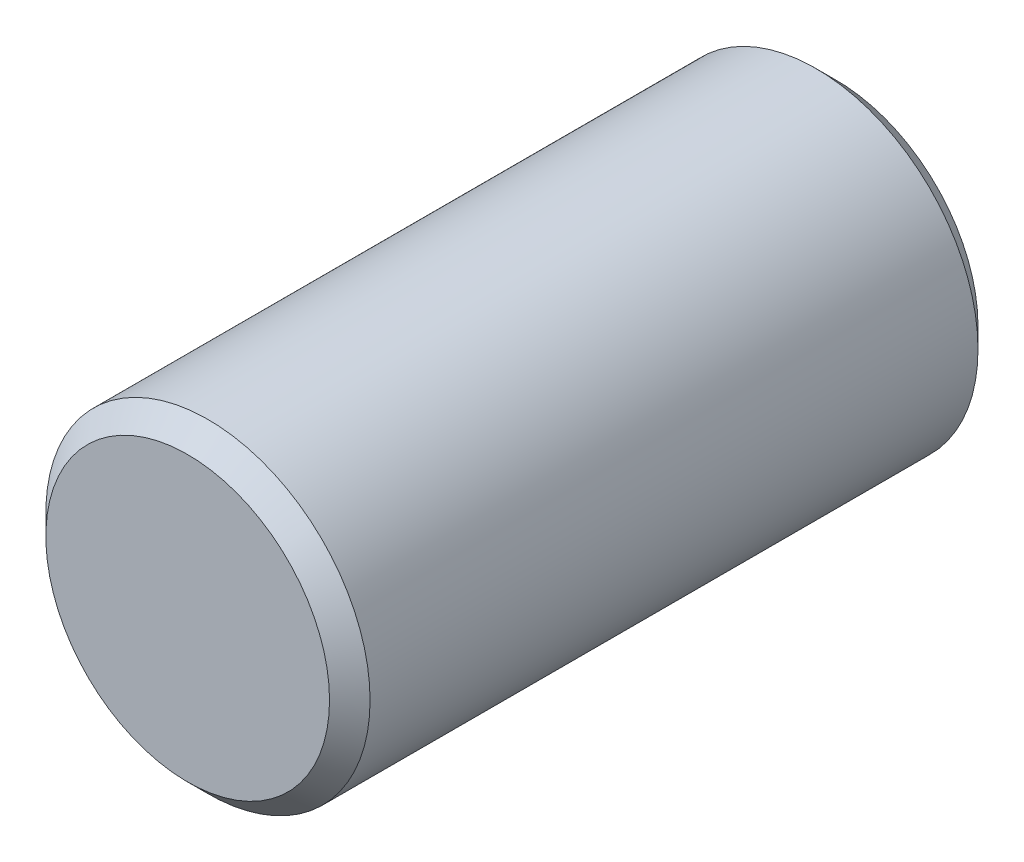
ISO-10303-21;
HEADER;
FILE_DESCRIPTION(('STEP AP214'),'2;1');
FILE_NAME('part.step','',(''),(''),'','','');
FILE_SCHEMA(('AUTOMOTIVE_DESIGN { 1 0 10303 214 1 1 1 1 }'));
ENDSEC;
DATA;
#1=APPLICATION_CONTEXT('core data for automotive mechanical design processes');
#2=APPLICATION_PROTOCOL_DEFINITION('international standard','automotive_design',2000,#1);
#3=PRODUCT_CONTEXT('',#1,'mechanical');
#4=PRODUCT('Part','Part','',(#3));
#5=PRODUCT_RELATED_PRODUCT_CATEGORY('part','',(#4));
#6=PRODUCT_DEFINITION_FORMATION('','',#4);
#7=PRODUCT_DEFINITION_CONTEXT('part definition',#1,'design');
#8=PRODUCT_DEFINITION('design','',#6,#7);
#9=PRODUCT_DEFINITION_SHAPE('','',#8);
#10=(LENGTH_UNIT() NAMED_UNIT(*) SI_UNIT(.MILLI.,.METRE.));
#11=(NAMED_UNIT(*) PLANE_ANGLE_UNIT() SI_UNIT($,.RADIAN.));
#12=(NAMED_UNIT(*) SI_UNIT($,.STERADIAN.) SOLID_ANGLE_UNIT());
#13=UNCERTAINTY_MEASURE_WITH_UNIT(LENGTH_MEASURE(1.E-05),#10,'distance_accuracy_value','');
#14=(GEOMETRIC_REPRESENTATION_CONTEXT(3) GLOBAL_UNCERTAINTY_ASSIGNED_CONTEXT((#13)) GLOBAL_UNIT_ASSIGNED_CONTEXT((#10,
#11,#12)) REPRESENTATION_CONTEXT('',''));
#15=CARTESIAN_POINT('',(0.,0.,0.));
#16=DIRECTION('',(0.,0.,1.));
#17=DIRECTION('',(1.,0.,0.));
#18=AXIS2_PLACEMENT_3D('',#15,#16,#17);
#19=CARTESIAN_POINT('',(0.,0.,-10.6746912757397));
#20=DIRECTION('',(0.,0.,1.));
#21=DIRECTION('',(1.,0.,0.));
#22=AXIS2_PLACEMENT_3D('',#19,#20,#21);
#23=CYLINDRICAL_SURFACE('',#22,2.);
#24=CARTESIAN_POINT('',(0.,0.,-0.250013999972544));
#25=DIRECTION('',(0.,0.,1.));
#26=DIRECTION('',(1.,0.,0.));
#27=AXIS2_PLACEMENT_3D('',#24,#25,#26);
#28=CIRCLE('',#27,2.);
#29=CARTESIAN_POINT('',(2.,0.,-0.250013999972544));
#30=VERTEX_POINT('',#29);
#31=EDGE_CURVE('E10',#30,#30,#28,.T.);
#32=ORIENTED_EDGE('',*,*,#31,.F.);
#33=EDGE_LOOP('',(#32));
#34=FACE_BOUND('',#33,.T.);
#35=CARTESIAN_POINT('',(0.,0.,-7.74998600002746));
#36=DIRECTION('',(0.,0.,1.));
#37=DIRECTION('',(1.,0.,0.));
#38=AXIS2_PLACEMENT_3D('',#35,#36,#37);
#39=CIRCLE('',#38,2.);
#40=CARTESIAN_POINT('',(2.,0.,-7.74998600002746));
#41=VERTEX_POINT('',#40);
#42=EDGE_CURVE('E42',#41,#41,#39,.T.);
#43=ORIENTED_EDGE('',*,*,#42,.T.);
#44=EDGE_LOOP('',(#43));
#45=FACE_BOUND('',#44,.T.);
#46=ADVANCED_FACE('F28',(#34,#45),#23,.T.);
#47=CARTESIAN_POINT('',(0.,0.,-0.250013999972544));
#48=DIRECTION('',(0.,0.,-1.));
#49=DIRECTION('',(-1.,0.,0.));
#50=AXIS2_PLACEMENT_3D('',#47,#48,#49);
#51=CONICAL_SURFACE('',#50,2.,0.785398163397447);
#52=CARTESIAN_POINT('',(0.,0.,0.));
#53=DIRECTION('',(0.,0.,1.));
#54=DIRECTION('',(1.,0.,0.));
#55=AXIS2_PLACEMENT_3D('',#52,#53,#54);
#56=CIRCLE('',#55,1.74998600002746);
#57=CARTESIAN_POINT('',(1.74998600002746,0.,0.));
#58=VERTEX_POINT('',#57);
#59=EDGE_CURVE('E34',#58,#58,#56,.T.);
#60=ORIENTED_EDGE('',*,*,#59,.F.);
#61=EDGE_LOOP('',(#60));
#62=FACE_BOUND('',#61,.T.);
#63=ORIENTED_EDGE('',*,*,#31,.T.);
#64=EDGE_LOOP('',(#63));
#65=FACE_BOUND('',#64,.T.);
#66=ADVANCED_FACE('F62',(#62,#65),#51,.T.);
#67=CARTESIAN_POINT('',(0.,1.74998600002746,0.));
#68=DIRECTION('',(0.,0.,-1.));
#69=DIRECTION('',(-1.,0.,0.));
#70=AXIS2_PLACEMENT_3D('',#67,#68,#69);
#71=PLANE('',#70);
#72=ORIENTED_EDGE('',*,*,#59,.T.);
#73=EDGE_LOOP('',(#72));
#74=FACE_BOUND('',#73,.T.);
#75=ADVANCED_FACE('F57',(#74),#71,.F.);
#76=CARTESIAN_POINT('',(0.,0.,-8.));
#77=DIRECTION('',(0.,0.,1.));
#78=DIRECTION('',(1.,0.,0.));
#79=AXIS2_PLACEMENT_3D('',#76,#77,#78);
#80=PLANE('',#79);
#81=CARTESIAN_POINT('',(0.,0.,-8.));
#82=DIRECTION('',(0.,0.,1.));
#83=DIRECTION('',(1.,0.,0.));
#84=AXIS2_PLACEMENT_3D('',#81,#82,#83);
#85=CIRCLE('',#84,1.74998600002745);
#86=CARTESIAN_POINT('',(1.74998600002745,0.,-8.));
#87=VERTEX_POINT('',#86);
#88=EDGE_CURVE('E38',#87,#87,#85,.T.);
#89=ORIENTED_EDGE('',*,*,#88,.F.);
#90=EDGE_LOOP('',(#89));
#91=FACE_BOUND('',#90,.T.);
#92=ADVANCED_FACE('F52',(#91),#80,.F.);
#93=CARTESIAN_POINT('',(0.,0.,-8.));
#94=DIRECTION('',(0.,0.,1.));
#95=DIRECTION('',(1.,0.,0.));
#96=AXIS2_PLACEMENT_3D('',#93,#94,#95);
#97=CONICAL_SURFACE('',#96,1.74998600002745,0.785398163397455);
#98=ORIENTED_EDGE('',*,*,#42,.F.);
#99=EDGE_LOOP('',(#98));
#100=FACE_BOUND('',#99,.T.);
#101=ORIENTED_EDGE('',*,*,#88,.T.);
#102=EDGE_LOOP('',(#101));
#103=FACE_BOUND('',#102,.T.);
#104=ADVANCED_FACE('F49',(#100,#103),#97,.T.);
#105=CLOSED_SHELL('',(#46,#66,#75,#92,#104));
#106=MANIFOLD_SOLID_BREP('B2',#105);
#107=ADVANCED_BREP_SHAPE_REPRESENTATION('',(#18,#106),#14);
#108=SHAPE_DEFINITION_REPRESENTATION(#9,#107);
ENDSEC;
END-ISO-10303-21;
